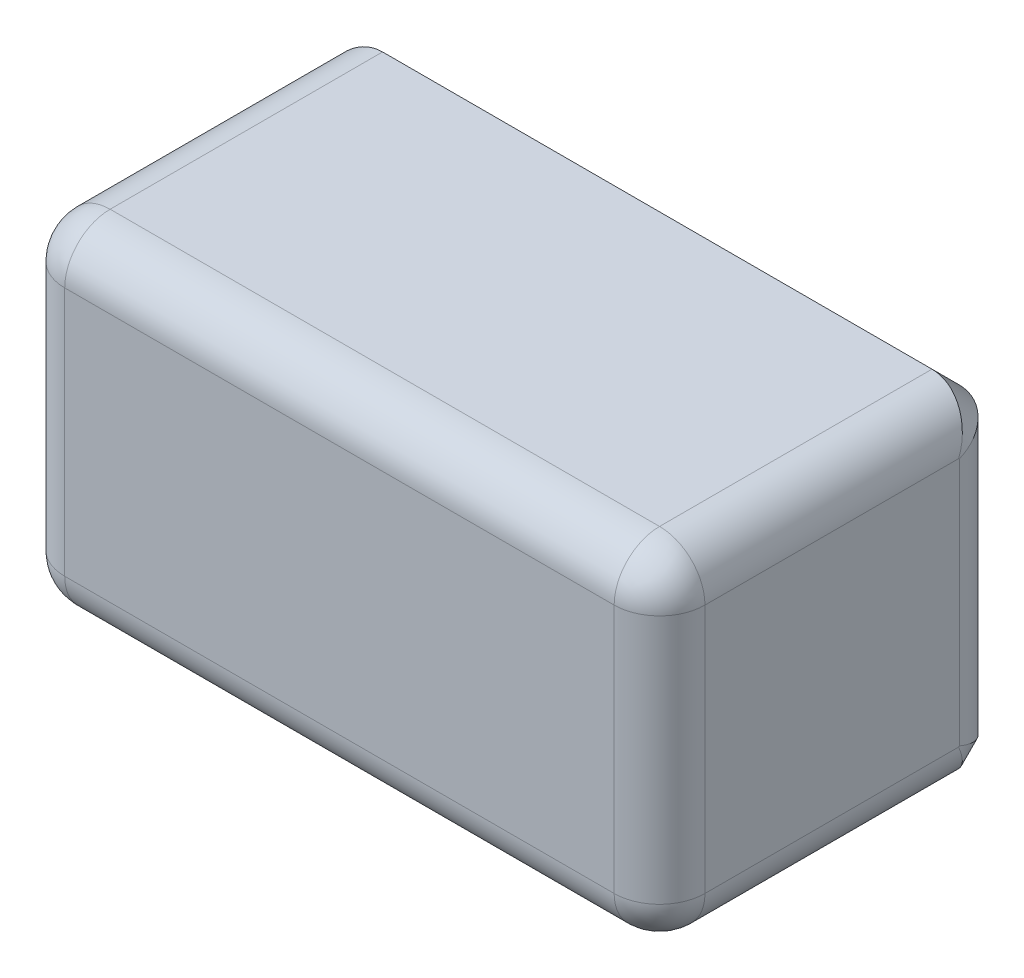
ISO-10303-21;
HEADER;
FILE_DESCRIPTION(('STEP AP214'),'2;1');
FILE_NAME('part.step','',(''),(''),'','','');
FILE_SCHEMA(('AUTOMOTIVE_DESIGN { 1 0 10303 214 1 1 1 1 }'));
ENDSEC;
DATA;
#1=APPLICATION_CONTEXT('core data for automotive mechanical design processes');
#2=APPLICATION_PROTOCOL_DEFINITION('international standard','automotive_design',2000,#1);
#3=PRODUCT_CONTEXT('',#1,'mechanical');
#4=PRODUCT('Part','Part','',(#3));
#5=PRODUCT_RELATED_PRODUCT_CATEGORY('part','',(#4));
#6=PRODUCT_DEFINITION_FORMATION('','',#4);
#7=PRODUCT_DEFINITION_CONTEXT('part definition',#1,'design');
#8=PRODUCT_DEFINITION('design','',#6,#7);
#9=PRODUCT_DEFINITION_SHAPE('','',#8);
#10=(LENGTH_UNIT() NAMED_UNIT(*) SI_UNIT(.MILLI.,.METRE.));
#11=(NAMED_UNIT(*) PLANE_ANGLE_UNIT() SI_UNIT($,.RADIAN.));
#12=(NAMED_UNIT(*) SI_UNIT($,.STERADIAN.) SOLID_ANGLE_UNIT());
#13=UNCERTAINTY_MEASURE_WITH_UNIT(LENGTH_MEASURE(1.E-05),#10,'distance_accuracy_value','');
#14=(GEOMETRIC_REPRESENTATION_CONTEXT(3) GLOBAL_UNCERTAINTY_ASSIGNED_CONTEXT((#13)) GLOBAL_UNIT_ASSIGNED_CONTEXT((#10,
#11,#12)) REPRESENTATION_CONTEXT('',''));
#15=CARTESIAN_POINT('',(0.,0.,0.));
#16=DIRECTION('',(0.,0.,1.));
#17=DIRECTION('',(1.,0.,0.));
#18=AXIS2_PLACEMENT_3D('',#15,#16,#17);
#19=CARTESIAN_POINT('',(-35.25,18.75,-19.));
#20=DIRECTION('',(0.,1.,0.));
#21=DIRECTION('',(0.,0.,1.));
#22=AXIS2_PLACEMENT_3D('',#19,#20,#21);
#23=PLANE('',#22);
#24=DIRECTION('',(-1.,0.,0.));
#25=VECTOR('',#24,1.);
#26=CARTESIAN_POINT('',(-35.25,18.75,14.));
#27=LINE('',#26,#25);
#28=CARTESIAN_POINT('',(-30.25,18.75,14.));
#29=VERTEX_POINT('',#28);
#30=CARTESIAN_POINT('',(30.25,18.75,14.));
#31=VERTEX_POINT('',#30);
#32=EDGE_CURVE('E187',#29,#31,#27,.F.);
#33=ORIENTED_EDGE('',*,*,#32,.T.);
#34=DIRECTION('',(0.,0.,1.));
#35=VECTOR('',#34,1.);
#36=CARTESIAN_POINT('',(30.25,18.75,-19.));
#37=LINE('',#36,#35);
#38=CARTESIAN_POINT('',(30.25,18.75,-16.));
#39=VERTEX_POINT('',#38);
#40=EDGE_CURVE('E191',#31,#39,#37,.F.);
#41=ORIENTED_EDGE('',*,*,#40,.T.);
#42=DIRECTION('',(-1.,0.,0.));
#43=VECTOR('',#42,1.);
#44=CARTESIAN_POINT('',(-35.25,18.75,-16.));
#45=LINE('',#44,#43);
#46=CARTESIAN_POINT('',(-30.25,18.75,-16.));
#47=VERTEX_POINT('',#46);
#48=EDGE_CURVE('E260',#39,#47,#45,.T.);
#49=ORIENTED_EDGE('',*,*,#48,.T.);
#50=DIRECTION('',(0.,0.,1.));
#51=VECTOR('',#50,1.);
#52=CARTESIAN_POINT('',(-30.25,18.75,-19.));
#53=LINE('',#52,#51);
#54=EDGE_CURVE('E189',#47,#29,#53,.T.);
#55=ORIENTED_EDGE('',*,*,#54,.T.);
#56=EDGE_LOOP('',(#33,#41,#49,#55));
#57=FACE_BOUND('',#56,.T.);
#58=ADVANCED_FACE('F37',(#57),#23,.T.);
#59=CARTESIAN_POINT('',(35.25,-18.75,-19.));
#60=DIRECTION('',(1.,0.,0.));
#61=DIRECTION('',(0.,0.,-1.));
#62=AXIS2_PLACEMENT_3D('',#59,#60,#61);
#63=PLANE('',#62);
#64=DIRECTION('',(0.,0.,1.));
#65=VECTOR('',#64,1.);
#66=CARTESIAN_POINT('',(35.25,-13.75,-19.));
#67=LINE('',#66,#65);
#68=CARTESIAN_POINT('',(35.25,-13.75,14.));
#69=VERTEX_POINT('',#68);
#70=CARTESIAN_POINT('',(35.25,-13.75,-13.9289321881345));
#71=VERTEX_POINT('',#70);
#72=EDGE_CURVE('E162',#69,#71,#67,.F.);
#73=ORIENTED_EDGE('',*,*,#72,.T.);
#74=DIRECTION('',(0.,0.707106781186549,-0.707106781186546));
#75=VECTOR('',#74,1.);
#76=CARTESIAN_POINT('',(35.25,-13.7144660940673,-13.9644660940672));
#77=LINE('',#76,#75);
#78=CARTESIAN_POINT('',(35.25,-13.6789321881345,-14.));
#79=VERTEX_POINT('',#78);
#80=EDGE_CURVE('E143',#71,#79,#77,.T.);
#81=ORIENTED_EDGE('',*,*,#80,.T.);
#82=DIRECTION('',(0.,1.,0.));
#83=VECTOR('',#82,1.);
#84=CARTESIAN_POINT('',(35.25,15.75,-14.));
#85=LINE('',#84,#83);
#86=CARTESIAN_POINT('',(35.25,13.6789321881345,-14.));
#87=VERTEX_POINT('',#86);
#88=EDGE_CURVE('E151',#79,#87,#85,.T.);
#89=ORIENTED_EDGE('',*,*,#88,.T.);
#90=DIRECTION('',(0.,0.707106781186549,0.707106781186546));
#91=VECTOR('',#90,1.);
#92=CARTESIAN_POINT('',(35.25,-5.03553390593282,-32.7144660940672));
#93=LINE('',#92,#91);
#94=CARTESIAN_POINT('',(35.25,13.75,-13.9289321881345));
#95=VERTEX_POINT('',#94);
#96=EDGE_CURVE('E157',#87,#95,#93,.T.);
#97=ORIENTED_EDGE('',*,*,#96,.T.);
#98=DIRECTION('',(0.,0.,1.));
#99=VECTOR('',#98,1.);
#100=CARTESIAN_POINT('',(35.25,13.75,-19.));
#101=LINE('',#100,#99);
#102=CARTESIAN_POINT('',(35.25,13.75,14.));
#103=VERTEX_POINT('',#102);
#104=EDGE_CURVE('E279',#95,#103,#101,.T.);
#105=ORIENTED_EDGE('',*,*,#104,.T.);
#106=DIRECTION('',(0.,1.,0.));
#107=VECTOR('',#106,1.);
#108=CARTESIAN_POINT('',(35.25,-18.75,14.));
#109=LINE('',#108,#107);
#110=EDGE_CURVE('E167',#103,#69,#109,.F.);
#111=ORIENTED_EDGE('',*,*,#110,.T.);
#112=EDGE_LOOP('',(#73,#81,#89,#97,#105,#111));
#113=FACE_BOUND('',#112,.T.);
#114=ADVANCED_FACE('F160',(#113),#63,.T.);
#115=CARTESIAN_POINT('',(-35.25,-18.75,-19.));
#116=DIRECTION('',(0.,-1.,0.));
#117=DIRECTION('',(0.,0.,-1.));
#118=AXIS2_PLACEMENT_3D('',#115,#116,#117);
#119=PLANE('',#118);
#120=DIRECTION('',(1.,0.,0.));
#121=VECTOR('',#120,1.);
#122=CARTESIAN_POINT('',(35.25,-18.75,-16.));
#123=LINE('',#122,#121);
#124=CARTESIAN_POINT('',(-30.25,-18.75,-16.));
#125=VERTEX_POINT('',#124);
#126=CARTESIAN_POINT('',(30.25,-18.75,-16.));
#127=VERTEX_POINT('',#126);
#128=EDGE_CURVE('E158',#125,#127,#123,.T.);
#129=ORIENTED_EDGE('',*,*,#128,.T.);
#130=DIRECTION('',(0.,0.,1.));
#131=VECTOR('',#130,1.);
#132=CARTESIAN_POINT('',(30.25,-18.75,-19.));
#133=LINE('',#132,#131);
#134=CARTESIAN_POINT('',(30.25,-18.75,14.));
#135=VERTEX_POINT('',#134);
#136=EDGE_CURVE('E176',#127,#135,#133,.T.);
#137=ORIENTED_EDGE('',*,*,#136,.T.);
#138=DIRECTION('',(1.,0.,0.));
#139=VECTOR('',#138,1.);
#140=CARTESIAN_POINT('',(-35.25,-18.75,14.));
#141=LINE('',#140,#139);
#142=CARTESIAN_POINT('',(-30.25,-18.75,14.));
#143=VERTEX_POINT('',#142);
#144=EDGE_CURVE('E172',#135,#143,#141,.F.);
#145=ORIENTED_EDGE('',*,*,#144,.T.);
#146=DIRECTION('',(0.,0.,1.));
#147=VECTOR('',#146,1.);
#148=CARTESIAN_POINT('',(-30.25,-18.75,-19.));
#149=LINE('',#148,#147);
#150=EDGE_CURVE('E174',#143,#125,#149,.F.);
#151=ORIENTED_EDGE('',*,*,#150,.T.);
#152=EDGE_LOOP('',(#129,#137,#145,#151));
#153=FACE_BOUND('',#152,.T.);
#154=ADVANCED_FACE('F300',(#153),#119,.T.);
#155=CARTESIAN_POINT('',(-35.25,-18.75,-19.));
#156=DIRECTION('',(-1.,0.,0.));
#157=DIRECTION('',(0.,0.,1.));
#158=AXIS2_PLACEMENT_3D('',#155,#156,#157);
#159=PLANE('',#158);
#160=DIRECTION('',(0.,0.,1.));
#161=VECTOR('',#160,1.);
#162=CARTESIAN_POINT('',(-35.25,-13.75,-19.));
#163=LINE('',#162,#161);
#164=CARTESIAN_POINT('',(-35.25,-13.75,-13.9289321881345));
#165=VERTEX_POINT('',#164);
#166=CARTESIAN_POINT('',(-35.25,-13.75,14.));
#167=VERTEX_POINT('',#166);
#168=EDGE_CURVE('E46',#165,#167,#163,.T.);
#169=ORIENTED_EDGE('',*,*,#168,.T.);
#170=DIRECTION('',(0.,-1.,0.));
#171=VECTOR('',#170,1.);
#172=CARTESIAN_POINT('',(-35.25,-18.75,14.));
#173=LINE('',#172,#171);
#174=CARTESIAN_POINT('',(-35.25,13.75,14.));
#175=VERTEX_POINT('',#174);
#176=EDGE_CURVE('E11',#167,#175,#173,.F.);
#177=ORIENTED_EDGE('',*,*,#176,.T.);
#178=DIRECTION('',(0.,0.,1.));
#179=VECTOR('',#178,1.);
#180=CARTESIAN_POINT('',(-35.25,13.75,-19.));
#181=LINE('',#180,#179);
#182=CARTESIAN_POINT('',(-35.25,13.75,-13.9289321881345));
#183=VERTEX_POINT('',#182);
#184=EDGE_CURVE('E201',#175,#183,#181,.F.);
#185=ORIENTED_EDGE('',*,*,#184,.T.);
#186=DIRECTION('',(0.,-0.707106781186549,-0.707106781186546));
#187=VECTOR('',#186,1.);
#188=CARTESIAN_POINT('',(-35.25,-5.03553390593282,-32.7144660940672));
#189=LINE('',#188,#187);
#190=CARTESIAN_POINT('',(-35.25,13.6789321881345,-14.));
#191=VERTEX_POINT('',#190);
#192=EDGE_CURVE('E203',#183,#191,#189,.T.);
#193=ORIENTED_EDGE('',*,*,#192,.T.);
#194=DIRECTION('',(0.,-1.,0.));
#195=VECTOR('',#194,1.);
#196=CARTESIAN_POINT('',(-35.25,-15.75,-14.));
#197=LINE('',#196,#195);
#198=CARTESIAN_POINT('',(-35.25,-13.6789321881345,-14.));
#199=VERTEX_POINT('',#198);
#200=EDGE_CURVE('E205',#191,#199,#197,.T.);
#201=ORIENTED_EDGE('',*,*,#200,.T.);
#202=DIRECTION('',(0.,-0.707106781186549,0.707106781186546));
#203=VECTOR('',#202,1.);
#204=CARTESIAN_POINT('',(-35.25,-13.7144660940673,-13.9644660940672));
#205=LINE('',#204,#203);
#206=EDGE_CURVE('E57',#199,#165,#205,.T.);
#207=ORIENTED_EDGE('',*,*,#206,.T.);
#208=EDGE_LOOP('',(#169,#177,#185,#193,#201,#207));
#209=FACE_BOUND('',#208,.T.);
#210=ADVANCED_FACE('F319',(#209),#159,.T.);
#211=CARTESIAN_POINT('',(0.,0.,-19.));
#212=DIRECTION('',(0.,0.,1.));
#213=DIRECTION('',(1.,0.,0.));
#214=AXIS2_PLACEMENT_3D('',#211,#212,#213);
#215=PLANE('',#214);
#216=DIRECTION('',(1.,0.,0.));
#217=VECTOR('',#216,1.);
#218=CARTESIAN_POINT('',(35.25,15.75,-19.));
#219=LINE('',#218,#217);
#220=CARTESIAN_POINT('',(-30.25,15.75,-19.));
#221=VERTEX_POINT('',#220);
#222=CARTESIAN_POINT('',(30.25,15.75,-19.));
#223=VERTEX_POINT('',#222);
#224=EDGE_CURVE('E271',#221,#223,#219,.T.);
#225=ORIENTED_EDGE('',*,*,#224,.T.);
#226=DIRECTION('',(0.,1.,0.));
#227=VECTOR('',#226,1.);
#228=CARTESIAN_POINT('',(30.25,-15.75,-19.));
#229=LINE('',#228,#227);
#230=CARTESIAN_POINT('',(30.25,-15.75,-19.));
#231=VERTEX_POINT('',#230);
#232=EDGE_CURVE('E199',#223,#231,#229,.F.);
#233=ORIENTED_EDGE('',*,*,#232,.T.);
#234=DIRECTION('',(-1.,0.,0.));
#235=VECTOR('',#234,1.);
#236=CARTESIAN_POINT('',(-35.25,-15.75,-19.));
#237=LINE('',#236,#235);
#238=CARTESIAN_POINT('',(-30.25,-15.75,-19.));
#239=VERTEX_POINT('',#238);
#240=EDGE_CURVE('E266',#231,#239,#237,.T.);
#241=ORIENTED_EDGE('',*,*,#240,.T.);
#242=DIRECTION('',(0.,-1.,0.));
#243=VECTOR('',#242,1.);
#244=CARTESIAN_POINT('',(-30.25,15.75,-19.));
#245=LINE('',#244,#243);
#246=EDGE_CURVE('E197',#239,#221,#245,.F.);
#247=ORIENTED_EDGE('',*,*,#246,.T.);
#248=EDGE_LOOP('',(#225,#233,#241,#247));
#249=FACE_BOUND('',#248,.T.);
#250=ADVANCED_FACE('F329',(#249),#215,.F.);
#251=CARTESIAN_POINT('',(0.,0.,19.));
#252=DIRECTION('',(0.,0.,1.));
#253=DIRECTION('',(1.,0.,0.));
#254=AXIS2_PLACEMENT_3D('',#251,#252,#253);
#255=PLANE('',#254);
#256=DIRECTION('',(0.,-1.,0.));
#257=VECTOR('',#256,1.);
#258=CARTESIAN_POINT('',(-30.25,0.,19.));
#259=LINE('',#258,#257);
#260=CARTESIAN_POINT('',(-30.25,13.75,19.));
#261=VERTEX_POINT('',#260);
#262=CARTESIAN_POINT('',(-30.25,-13.75,19.));
#263=VERTEX_POINT('',#262);
#264=EDGE_CURVE('E180',#261,#263,#259,.T.);
#265=ORIENTED_EDGE('',*,*,#264,.T.);
#266=DIRECTION('',(1.,0.,0.));
#267=VECTOR('',#266,1.);
#268=CARTESIAN_POINT('',(0.,-13.75,19.));
#269=LINE('',#268,#267);
#270=CARTESIAN_POINT('',(30.25,-13.75,19.));
#271=VERTEX_POINT('',#270);
#272=EDGE_CURVE('E185',#263,#271,#269,.T.);
#273=ORIENTED_EDGE('',*,*,#272,.T.);
#274=DIRECTION('',(0.,1.,0.));
#275=VECTOR('',#274,1.);
#276=CARTESIAN_POINT('',(30.25,0.,19.));
#277=LINE('',#276,#275);
#278=CARTESIAN_POINT('',(30.25,13.75,19.));
#279=VERTEX_POINT('',#278);
#280=EDGE_CURVE('E182',#271,#279,#277,.T.);
#281=ORIENTED_EDGE('',*,*,#280,.T.);
#282=DIRECTION('',(-1.,0.,0.));
#283=VECTOR('',#282,1.);
#284=CARTESIAN_POINT('',(0.,13.75,19.));
#285=LINE('',#284,#283);
#286=EDGE_CURVE('E178',#279,#261,#285,.T.);
#287=ORIENTED_EDGE('',*,*,#286,.T.);
#288=EDGE_LOOP('',(#265,#273,#281,#287));
#289=FACE_BOUND('',#288,.T.);
#290=ADVANCED_FACE('F313',(#289),#255,.T.);
#291=CARTESIAN_POINT('',(-35.25,18.75,-16.));
#292=DIRECTION('',(0.,0.707106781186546,-0.707106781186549));
#293=DIRECTION('',(1.,0.,0.));
#294=AXIS2_PLACEMENT_3D('',#291,#292,#293);
#295=PLANE('',#294);
#296=ORIENTED_EDGE('',*,*,#48,.F.);
#297=DIRECTION('',(0.,0.707106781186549,0.707106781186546));
#298=VECTOR('',#297,1.);
#299=CARTESIAN_POINT('',(30.25,18.75,-16.));
#300=LINE('',#299,#298);
#301=EDGE_CURVE('E195',#39,#223,#300,.F.);
#302=ORIENTED_EDGE('',*,*,#301,.T.);
#303=ORIENTED_EDGE('',*,*,#224,.F.);
#304=DIRECTION('',(0.,-0.707106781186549,-0.707106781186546));
#305=VECTOR('',#304,1.);
#306=CARTESIAN_POINT('',(-30.25,18.75,-16.));
#307=LINE('',#306,#305);
#308=EDGE_CURVE('E193',#221,#47,#307,.F.);
#309=ORIENTED_EDGE('',*,*,#308,.T.);
#310=EDGE_LOOP('',(#296,#302,#303,#309));
#311=FACE_BOUND('',#310,.T.);
#312=ADVANCED_FACE('F351',(#311),#295,.T.);
#313=CARTESIAN_POINT('',(-35.25,-18.75,-16.));
#314=DIRECTION('',(0.,-0.707106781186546,-0.707106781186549));
#315=DIRECTION('',(-1.,0.,0.));
#316=AXIS2_PLACEMENT_3D('',#313,#314,#315);
#317=PLANE('',#316);
#318=ORIENTED_EDGE('',*,*,#240,.F.);
#319=DIRECTION('',(0.,0.707106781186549,-0.707106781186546));
#320=VECTOR('',#319,1.);
#321=CARTESIAN_POINT('',(30.25,-18.75,-16.));
#322=LINE('',#321,#320);
#323=EDGE_CURVE('E145',#231,#127,#322,.F.);
#324=ORIENTED_EDGE('',*,*,#323,.T.);
#325=ORIENTED_EDGE('',*,*,#128,.F.);
#326=DIRECTION('',(0.,-0.707106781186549,0.707106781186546));
#327=VECTOR('',#326,1.);
#328=CARTESIAN_POINT('',(-30.25,-18.75,-16.));
#329=LINE('',#328,#327);
#330=EDGE_CURVE('E164',#125,#239,#329,.F.);
#331=ORIENTED_EDGE('',*,*,#330,.T.);
#332=EDGE_LOOP('',(#318,#324,#325,#331));
#333=FACE_BOUND('',#332,.T.);
#334=ADVANCED_FACE('F298',(#333),#317,.T.);
#335=CARTESIAN_POINT('',(-30.25,-5.03553390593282,-32.7144660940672));
#336=DIRECTION('',(0.,-0.707106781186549,-0.707106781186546));
#337=DIRECTION('',(0.,0.707106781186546,-0.707106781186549));
#338=AXIS2_PLACEMENT_3D('',#335,#336,#337);
#339=CYLINDRICAL_SURFACE('',#338,5.);
#340=CARTESIAN_POINT('',(-30.25,13.75,-13.9289321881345));
#341=DIRECTION('',(0.,0.382683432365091,0.923879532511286));
#342=DIRECTION('',(0.,-0.923879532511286,0.382683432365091));
#343=AXIS2_PLACEMENT_3D('',#340,#341,#342);
#344=ELLIPSE('',#343,5.41196100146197,5.);
#345=EDGE_CURVE('E253',#47,#183,#344,.T.);
#346=ORIENTED_EDGE('',*,*,#345,.F.);
#347=ORIENTED_EDGE('',*,*,#308,.F.);
#348=CARTESIAN_POINT('',(-30.25,13.6789321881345,-14.));
#349=DIRECTION('',(0.,-0.923879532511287,-0.382683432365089));
#350=DIRECTION('',(0.,0.382683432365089,-0.923879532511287));
#351=AXIS2_PLACEMENT_3D('',#348,#349,#350);
#352=ELLIPSE('',#351,5.41196100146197,5.);
#353=EDGE_CURVE('E41',#191,#221,#352,.T.);
#354=ORIENTED_EDGE('',*,*,#353,.F.);
#355=ORIENTED_EDGE('',*,*,#192,.F.);
#356=EDGE_LOOP('',(#346,#347,#354,#355));
#357=FACE_BOUND('',#356,.T.);
#358=ADVANCED_FACE('F39',(#357),#339,.T.);
#359=CARTESIAN_POINT('',(-30.25,-18.75,-14.));
#360=DIRECTION('',(0.,1.,0.));
#361=DIRECTION('',(0.,0.,1.));
#362=AXIS2_PLACEMENT_3D('',#359,#360,#361);
#363=CYLINDRICAL_SURFACE('',#362,5.);
#364=ORIENTED_EDGE('',*,*,#353,.T.);
#365=ORIENTED_EDGE('',*,*,#246,.F.);
#366=CARTESIAN_POINT('',(-30.25,-13.6789321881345,-14.));
#367=DIRECTION('',(0.,0.923879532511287,-0.382683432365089));
#368=DIRECTION('',(0.,0.382683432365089,0.923879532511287));
#369=AXIS2_PLACEMENT_3D('',#366,#367,#368);
#370=ELLIPSE('',#369,5.41196100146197,5.);
#371=EDGE_CURVE('E251',#199,#239,#370,.F.);
#372=ORIENTED_EDGE('',*,*,#371,.F.);
#373=ORIENTED_EDGE('',*,*,#200,.F.);
#374=EDGE_LOOP('',(#364,#365,#372,#373));
#375=FACE_BOUND('',#374,.T.);
#376=ADVANCED_FACE('F325',(#375),#363,.T.);
#377=CARTESIAN_POINT('',(-30.25,13.75,-19.));
#378=DIRECTION('',(0.,0.,1.));
#379=DIRECTION('',(1.,0.,0.));
#380=AXIS2_PLACEMENT_3D('',#377,#378,#379);
#381=CYLINDRICAL_SURFACE('',#380,5.);
#382=ORIENTED_EDGE('',*,*,#345,.T.);
#383=ORIENTED_EDGE('',*,*,#184,.F.);
#384=CARTESIAN_POINT('',(-30.25,13.75,14.));
#385=DIRECTION('',(0.,0.,1.));
#386=DIRECTION('',(1.,0.,0.));
#387=AXIS2_PLACEMENT_3D('',#384,#385,#386);
#388=CIRCLE('',#387,5.);
#389=EDGE_CURVE('E248',#29,#175,#388,.T.);
#390=ORIENTED_EDGE('',*,*,#389,.F.);
#391=ORIENTED_EDGE('',*,*,#54,.F.);
#392=EDGE_LOOP('',(#382,#383,#390,#391));
#393=FACE_BOUND('',#392,.T.);
#394=ADVANCED_FACE('F350',(#393),#381,.T.);
#395=CARTESIAN_POINT('',(-30.25,-13.7144660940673,-13.9644660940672));
#396=DIRECTION('',(0.,-0.707106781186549,0.707106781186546));
#397=DIRECTION('',(0.,-0.707106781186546,-0.707106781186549));
#398=AXIS2_PLACEMENT_3D('',#395,#396,#397);
#399=CYLINDRICAL_SURFACE('',#398,5.);
#400=ORIENTED_EDGE('',*,*,#371,.T.);
#401=ORIENTED_EDGE('',*,*,#330,.F.);
#402=CARTESIAN_POINT('',(-30.25,-13.75,-13.9289321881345));
#403=DIRECTION('',(0.,-0.382683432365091,0.923879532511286));
#404=DIRECTION('',(0.,-0.923879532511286,-0.382683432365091));
#405=AXIS2_PLACEMENT_3D('',#402,#403,#404);
#406=ELLIPSE('',#405,5.41196100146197,5.);
#407=EDGE_CURVE('E245',#165,#125,#406,.T.);
#408=ORIENTED_EDGE('',*,*,#407,.F.);
#409=ORIENTED_EDGE('',*,*,#206,.F.);
#410=EDGE_LOOP('',(#400,#401,#408,#409));
#411=FACE_BOUND('',#410,.T.);
#412=ADVANCED_FACE('F327',(#411),#399,.T.);
#413=CARTESIAN_POINT('',(-30.25,13.75,14.));
#414=DIRECTION('',(0.,0.,1.));
#415=DIRECTION('',(1.,0.,0.));
#416=AXIS2_PLACEMENT_3D('',#413,#414,#415);
#417=SPHERICAL_SURFACE('',#416,5.);
#418=CARTESIAN_POINT('',(-30.25,13.75,14.));
#419=DIRECTION('',(-1.,0.,0.));
#420=DIRECTION('',(0.,0.,1.));
#421=AXIS2_PLACEMENT_3D('',#418,#419,#420);
#422=CIRCLE('',#421,5.);
#423=EDGE_CURVE('E240',#29,#261,#422,.F.);
#424=ORIENTED_EDGE('',*,*,#423,.F.);
#425=ORIENTED_EDGE('',*,*,#389,.T.);
#426=CARTESIAN_POINT('',(-30.25,13.75,14.));
#427=DIRECTION('',(0.,1.,0.));
#428=DIRECTION('',(0.,0.,1.));
#429=AXIS2_PLACEMENT_3D('',#426,#427,#428);
#430=CIRCLE('',#429,5.);
#431=EDGE_CURVE('E243',#261,#175,#430,.F.);
#432=ORIENTED_EDGE('',*,*,#431,.F.);
#433=EDGE_LOOP('',(#424,#425,#432));
#434=FACE_BOUND('',#433,.T.);
#435=ADVANCED_FACE('F349',(#434),#417,.T.);
#436=CARTESIAN_POINT('',(-30.25,-13.75,-19.));
#437=DIRECTION('',(0.,0.,1.));
#438=DIRECTION('',(1.,0.,0.));
#439=AXIS2_PLACEMENT_3D('',#436,#437,#438);
#440=CYLINDRICAL_SURFACE('',#439,5.);
#441=ORIENTED_EDGE('',*,*,#407,.T.);
#442=ORIENTED_EDGE('',*,*,#150,.F.);
#443=CARTESIAN_POINT('',(-30.25,-13.75,14.));
#444=DIRECTION('',(0.,0.,1.));
#445=DIRECTION('',(1.,0.,0.));
#446=AXIS2_PLACEMENT_3D('',#443,#444,#445);
#447=CIRCLE('',#446,5.);
#448=EDGE_CURVE('E237',#167,#143,#447,.T.);
#449=ORIENTED_EDGE('',*,*,#448,.F.);
#450=ORIENTED_EDGE('',*,*,#168,.F.);
#451=EDGE_LOOP('',(#441,#442,#449,#450));
#452=FACE_BOUND('',#451,.T.);
#453=ADVANCED_FACE('F304',(#452),#440,.T.);
#454=CARTESIAN_POINT('',(-30.25,0.,14.));
#455=DIRECTION('',(0.,-1.,0.));
#456=DIRECTION('',(0.,0.,-1.));
#457=AXIS2_PLACEMENT_3D('',#454,#455,#456);
#458=CYLINDRICAL_SURFACE('',#457,5.);
#459=ORIENTED_EDGE('',*,*,#431,.T.);
#460=ORIENTED_EDGE('',*,*,#176,.F.);
#461=CARTESIAN_POINT('',(-30.25,-13.75,14.));
#462=DIRECTION('',(0.,-1.,0.));
#463=DIRECTION('',(0.,0.,-1.));
#464=AXIS2_PLACEMENT_3D('',#461,#462,#463);
#465=CIRCLE('',#464,5.);
#466=EDGE_CURVE('E234',#263,#167,#465,.T.);
#467=ORIENTED_EDGE('',*,*,#466,.F.);
#468=ORIENTED_EDGE('',*,*,#264,.F.);
#469=EDGE_LOOP('',(#459,#460,#467,#468));
#470=FACE_BOUND('',#469,.T.);
#471=ADVANCED_FACE('F317',(#470),#458,.T.);
#472=CARTESIAN_POINT('',(0.,13.75,14.));
#473=DIRECTION('',(-1.,0.,0.));
#474=DIRECTION('',(0.,0.,1.));
#475=AXIS2_PLACEMENT_3D('',#472,#473,#474);
#476=CYLINDRICAL_SURFACE('',#475,5.);
#477=ORIENTED_EDGE('',*,*,#423,.T.);
#478=ORIENTED_EDGE('',*,*,#286,.F.);
#479=CARTESIAN_POINT('',(30.25,13.75,14.));
#480=DIRECTION('',(1.,0.,0.));
#481=DIRECTION('',(0.,0.,-1.));
#482=AXIS2_PLACEMENT_3D('',#479,#480,#481);
#483=CIRCLE('',#482,5.);
#484=EDGE_CURVE('E231',#31,#279,#483,.T.);
#485=ORIENTED_EDGE('',*,*,#484,.F.);
#486=ORIENTED_EDGE('',*,*,#32,.F.);
#487=EDGE_LOOP('',(#477,#478,#485,#486));
#488=FACE_BOUND('',#487,.T.);
#489=ADVANCED_FACE('F346',(#488),#476,.T.);
#490=CARTESIAN_POINT('',(-30.25,-13.75,14.));
#491=DIRECTION('',(0.,0.,1.));
#492=DIRECTION('',(1.,0.,0.));
#493=AXIS2_PLACEMENT_3D('',#490,#491,#492);
#494=SPHERICAL_SURFACE('',#493,5.);
#495=ORIENTED_EDGE('',*,*,#466,.T.);
#496=ORIENTED_EDGE('',*,*,#448,.T.);
#497=CARTESIAN_POINT('',(-30.25,-13.75,14.));
#498=DIRECTION('',(-1.,0.,0.));
#499=DIRECTION('',(0.,0.,1.));
#500=AXIS2_PLACEMENT_3D('',#497,#498,#499);
#501=CIRCLE('',#500,5.);
#502=EDGE_CURVE('E228',#263,#143,#501,.F.);
#503=ORIENTED_EDGE('',*,*,#502,.F.);
#504=EDGE_LOOP('',(#495,#496,#503));
#505=FACE_BOUND('',#504,.T.);
#506=ADVANCED_FACE('F307',(#505),#494,.T.);
#507=CARTESIAN_POINT('',(30.25,13.75,14.));
#508=DIRECTION('',(0.,0.,1.));
#509=DIRECTION('',(1.,0.,0.));
#510=AXIS2_PLACEMENT_3D('',#507,#508,#509);
#511=SPHERICAL_SURFACE('',#510,5.);
#512=CARTESIAN_POINT('',(30.25,13.75,14.));
#513=DIRECTION('',(0.,0.,1.));
#514=DIRECTION('',(1.,0.,0.));
#515=AXIS2_PLACEMENT_3D('',#512,#513,#514);
#516=CIRCLE('',#515,5.);
#517=EDGE_CURVE('E223',#31,#103,#516,.F.);
#518=ORIENTED_EDGE('',*,*,#517,.F.);
#519=ORIENTED_EDGE('',*,*,#484,.T.);
#520=CARTESIAN_POINT('',(30.25,13.75,14.));
#521=DIRECTION('',(0.,1.,0.));
#522=DIRECTION('',(-1.,0.,0.));
#523=AXIS2_PLACEMENT_3D('',#520,#521,#522);
#524=CIRCLE('',#523,5.);
#525=EDGE_CURVE('E226',#103,#279,#524,.F.);
#526=ORIENTED_EDGE('',*,*,#525,.F.);
#527=EDGE_LOOP('',(#518,#519,#526));
#528=FACE_BOUND('',#527,.T.);
#529=ADVANCED_FACE('F342',(#528),#511,.T.);
#530=CARTESIAN_POINT('',(0.,-13.75,14.));
#531=DIRECTION('',(1.,0.,0.));
#532=DIRECTION('',(0.,0.,-1.));
#533=AXIS2_PLACEMENT_3D('',#530,#531,#532);
#534=CYLINDRICAL_SURFACE('',#533,5.);
#535=ORIENTED_EDGE('',*,*,#502,.T.);
#536=ORIENTED_EDGE('',*,*,#144,.F.);
#537=CARTESIAN_POINT('',(30.25,-13.75,14.));
#538=DIRECTION('',(1.,0.,0.));
#539=DIRECTION('',(0.,1.,0.));
#540=AXIS2_PLACEMENT_3D('',#537,#538,#539);
#541=CIRCLE('',#540,5.);
#542=EDGE_CURVE('E220',#271,#135,#541,.T.);
#543=ORIENTED_EDGE('',*,*,#542,.F.);
#544=ORIENTED_EDGE('',*,*,#272,.F.);
#545=EDGE_LOOP('',(#535,#536,#543,#544));
#546=FACE_BOUND('',#545,.T.);
#547=ADVANCED_FACE('F311',(#546),#534,.T.);
#548=CARTESIAN_POINT('',(30.25,0.,14.));
#549=DIRECTION('',(0.,1.,0.));
#550=DIRECTION('',(0.,0.,1.));
#551=AXIS2_PLACEMENT_3D('',#548,#549,#550);
#552=CYLINDRICAL_SURFACE('',#551,5.);
#553=ORIENTED_EDGE('',*,*,#525,.T.);
#554=ORIENTED_EDGE('',*,*,#280,.F.);
#555=CARTESIAN_POINT('',(30.25,-13.75,14.));
#556=DIRECTION('',(0.,-1.,0.));
#557=DIRECTION('',(0.,0.,-1.));
#558=AXIS2_PLACEMENT_3D('',#555,#556,#557);
#559=CIRCLE('',#558,5.);
#560=EDGE_CURVE('E217',#69,#271,#559,.T.);
#561=ORIENTED_EDGE('',*,*,#560,.F.);
#562=ORIENTED_EDGE('',*,*,#110,.F.);
#563=EDGE_LOOP('',(#553,#554,#561,#562));
#564=FACE_BOUND('',#563,.T.);
#565=ADVANCED_FACE('F286',(#564),#552,.T.);
#566=CARTESIAN_POINT('',(30.25,13.75,-19.));
#567=DIRECTION('',(0.,0.,1.));
#568=DIRECTION('',(1.,0.,0.));
#569=AXIS2_PLACEMENT_3D('',#566,#567,#568);
#570=CYLINDRICAL_SURFACE('',#569,5.);
#571=ORIENTED_EDGE('',*,*,#517,.T.);
#572=ORIENTED_EDGE('',*,*,#104,.F.);
#573=CARTESIAN_POINT('',(30.25,13.75,-13.9289321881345));
#574=DIRECTION('',(0.,0.382683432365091,0.923879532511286));
#575=DIRECTION('',(0.,0.923879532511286,-0.382683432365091));
#576=AXIS2_PLACEMENT_3D('',#573,#574,#575);
#577=ELLIPSE('',#576,5.41196100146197,5.);
#578=EDGE_CURVE('E214',#39,#95,#577,.F.);
#579=ORIENTED_EDGE('',*,*,#578,.F.);
#580=ORIENTED_EDGE('',*,*,#40,.F.);
#581=EDGE_LOOP('',(#571,#572,#579,#580));
#582=FACE_BOUND('',#581,.T.);
#583=ADVANCED_FACE('F337',(#582),#570,.T.);
#584=CARTESIAN_POINT('',(30.25,-13.75,14.));
#585=DIRECTION('',(0.,0.,1.));
#586=DIRECTION('',(1.,0.,0.));
#587=AXIS2_PLACEMENT_3D('',#584,#585,#586);
#588=SPHERICAL_SURFACE('',#587,5.);
#589=ORIENTED_EDGE('',*,*,#560,.T.);
#590=ORIENTED_EDGE('',*,*,#542,.T.);
#591=CARTESIAN_POINT('',(30.25,-13.75,14.));
#592=DIRECTION('',(0.,0.,1.));
#593=DIRECTION('',(1.,0.,0.));
#594=AXIS2_PLACEMENT_3D('',#591,#592,#593);
#595=CIRCLE('',#594,5.);
#596=EDGE_CURVE('E211',#69,#135,#595,.F.);
#597=ORIENTED_EDGE('',*,*,#596,.F.);
#598=EDGE_LOOP('',(#589,#590,#597));
#599=FACE_BOUND('',#598,.T.);
#600=ADVANCED_FACE('F289',(#599),#588,.T.);
#601=CARTESIAN_POINT('',(30.25,-5.03553390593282,-32.7144660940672));
#602=DIRECTION('',(0.,0.707106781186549,0.707106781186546));
#603=DIRECTION('',(0.,-0.707106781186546,0.707106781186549));
#604=AXIS2_PLACEMENT_3D('',#601,#602,#603);
#605=CYLINDRICAL_SURFACE('',#604,5.);
#606=ORIENTED_EDGE('',*,*,#578,.T.);
#607=ORIENTED_EDGE('',*,*,#96,.F.);
#608=CARTESIAN_POINT('',(30.25,13.6789321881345,-14.));
#609=DIRECTION('',(0.,-0.923879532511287,-0.382683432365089));
#610=DIRECTION('',(0.,-0.382683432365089,0.923879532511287));
#611=AXIS2_PLACEMENT_3D('',#608,#609,#610);
#612=ELLIPSE('',#611,5.41196100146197,5.);
#613=EDGE_CURVE('E154',#223,#87,#612,.T.);
#614=ORIENTED_EDGE('',*,*,#613,.F.);
#615=ORIENTED_EDGE('',*,*,#301,.F.);
#616=EDGE_LOOP('',(#606,#607,#614,#615));
#617=FACE_BOUND('',#616,.T.);
#618=ADVANCED_FACE('F334',(#617),#605,.T.);
#619=CARTESIAN_POINT('',(30.25,-13.75,-19.));
#620=DIRECTION('',(0.,0.,1.));
#621=DIRECTION('',(1.,0.,0.));
#622=AXIS2_PLACEMENT_3D('',#619,#620,#621);
#623=CYLINDRICAL_SURFACE('',#622,5.);
#624=ORIENTED_EDGE('',*,*,#596,.T.);
#625=ORIENTED_EDGE('',*,*,#136,.F.);
#626=CARTESIAN_POINT('',(30.25,-13.75,-13.9289321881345));
#627=DIRECTION('',(0.,-0.382683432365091,0.923879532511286));
#628=DIRECTION('',(0.,0.923879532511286,0.382683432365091));
#629=AXIS2_PLACEMENT_3D('',#626,#627,#628);
#630=ELLIPSE('',#629,5.41196100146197,5.);
#631=EDGE_CURVE('E148',#71,#127,#630,.F.);
#632=ORIENTED_EDGE('',*,*,#631,.F.);
#633=ORIENTED_EDGE('',*,*,#72,.F.);
#634=EDGE_LOOP('',(#624,#625,#632,#633));
#635=FACE_BOUND('',#634,.T.);
#636=ADVANCED_FACE('F292',(#635),#623,.T.);
#637=CARTESIAN_POINT('',(30.25,-18.75,-14.));
#638=DIRECTION('',(0.,-1.,0.));
#639=DIRECTION('',(0.,0.,-1.));
#640=AXIS2_PLACEMENT_3D('',#637,#638,#639);
#641=CYLINDRICAL_SURFACE('',#640,5.);
#642=ORIENTED_EDGE('',*,*,#613,.T.);
#643=ORIENTED_EDGE('',*,*,#88,.F.);
#644=CARTESIAN_POINT('',(30.25,-13.6789321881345,-14.));
#645=DIRECTION('',(0.,-0.923879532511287,0.382683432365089));
#646=DIRECTION('',(0.,-0.382683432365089,-0.923879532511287));
#647=AXIS2_PLACEMENT_3D('',#644,#645,#646);
#648=ELLIPSE('',#647,5.41196100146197,5.);
#649=EDGE_CURVE('E139',#231,#79,#648,.T.);
#650=ORIENTED_EDGE('',*,*,#649,.F.);
#651=ORIENTED_EDGE('',*,*,#232,.F.);
#652=EDGE_LOOP('',(#642,#643,#650,#651));
#653=FACE_BOUND('',#652,.T.);
#654=ADVANCED_FACE('F152',(#653),#641,.T.);
#655=CARTESIAN_POINT('',(30.25,-13.7144660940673,-13.9644660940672));
#656=DIRECTION('',(0.,0.707106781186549,-0.707106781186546));
#657=DIRECTION('',(0.,0.707106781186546,0.707106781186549));
#658=AXIS2_PLACEMENT_3D('',#655,#656,#657);
#659=CYLINDRICAL_SURFACE('',#658,5.);
#660=ORIENTED_EDGE('',*,*,#631,.T.);
#661=ORIENTED_EDGE('',*,*,#323,.F.);
#662=ORIENTED_EDGE('',*,*,#649,.T.);
#663=ORIENTED_EDGE('',*,*,#80,.F.);
#664=EDGE_LOOP('',(#660,#661,#662,#663));
#665=FACE_BOUND('',#664,.T.);
#666=ADVANCED_FACE('F141',(#665),#659,.T.);
#667=CLOSED_SHELL('',(#58,#114,#154,#210,#250,#290,#312,#334,#358,#376,#394,#412,#435,#453,#471,
#489,#506,#529,#547,#565,#583,#600,#618,#636,#654,#666));
#668=MANIFOLD_SOLID_BREP('B2',#667);
#669=ADVANCED_BREP_SHAPE_REPRESENTATION('',(#18,#668),#14);
#670=SHAPE_DEFINITION_REPRESENTATION(#9,#669);
ENDSEC;
END-ISO-10303-21;
